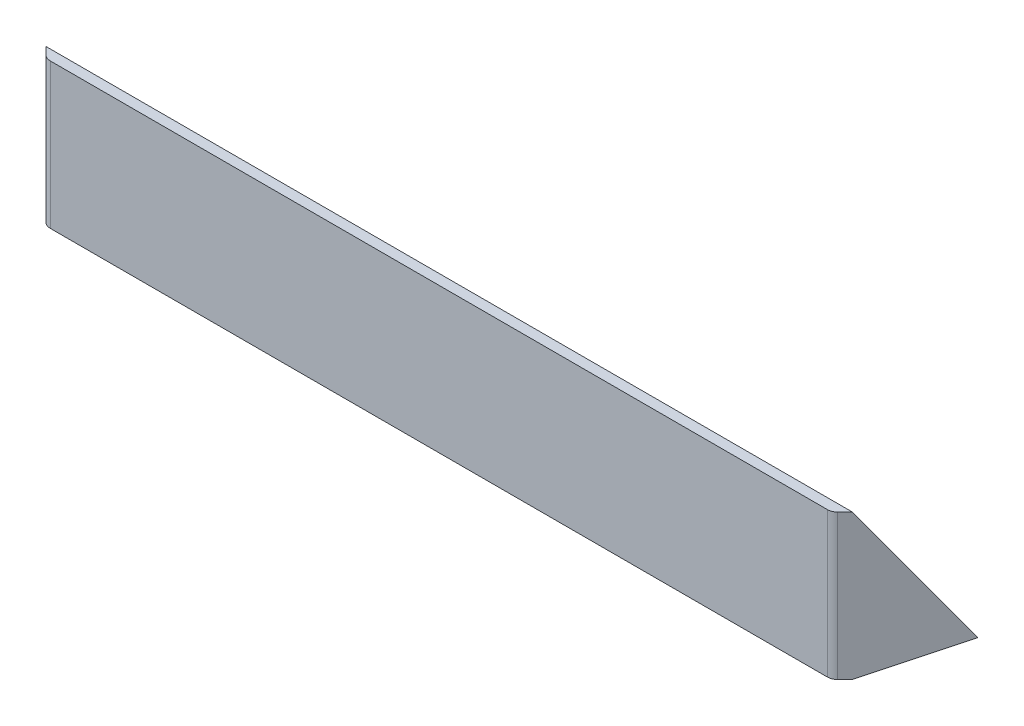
ISO-10303-21;
HEADER;
FILE_DESCRIPTION(('STEP AP214'),'2;1');
FILE_NAME('part.step','',(''),(''),'','','');
FILE_SCHEMA(('AUTOMOTIVE_DESIGN { 1 0 10303 214 1 1 1 1 }'));
ENDSEC;
DATA;
#1=APPLICATION_CONTEXT('core data for automotive mechanical design processes');
#2=APPLICATION_PROTOCOL_DEFINITION('international standard','automotive_design',2000,#1);
#3=PRODUCT_CONTEXT('',#1,'mechanical');
#4=PRODUCT('Part','Part','',(#3));
#5=PRODUCT_RELATED_PRODUCT_CATEGORY('part','',(#4));
#6=PRODUCT_DEFINITION_FORMATION('','',#4);
#7=PRODUCT_DEFINITION_CONTEXT('part definition',#1,'design');
#8=PRODUCT_DEFINITION('design','',#6,#7);
#9=PRODUCT_DEFINITION_SHAPE('','',#8);
#10=(LENGTH_UNIT() NAMED_UNIT(*) SI_UNIT(.MILLI.,.METRE.));
#11=(NAMED_UNIT(*) PLANE_ANGLE_UNIT() SI_UNIT($,.RADIAN.));
#12=(NAMED_UNIT(*) SI_UNIT($,.STERADIAN.) SOLID_ANGLE_UNIT());
#13=UNCERTAINTY_MEASURE_WITH_UNIT(LENGTH_MEASURE(1.E-05),#10,'distance_accuracy_value','');
#14=(GEOMETRIC_REPRESENTATION_CONTEXT(3) GLOBAL_UNCERTAINTY_ASSIGNED_CONTEXT((#13)) GLOBAL_UNIT_ASSIGNED_CONTEXT((#10,
#11,#12)) REPRESENTATION_CONTEXT('',''));
#15=CARTESIAN_POINT('',(0.,0.,0.));
#16=DIRECTION('',(0.,0.,1.));
#17=DIRECTION('',(1.,0.,0.));
#18=AXIS2_PLACEMENT_3D('',#15,#16,#17);
#19=CARTESIAN_POINT('',(379.142135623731,140.,0.));
#20=DIRECTION('',(-0.707106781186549,0.,-0.707106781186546));
#21=DIRECTION('',(-0.707106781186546,0.,0.707106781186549));
#22=AXIS2_PLACEMENT_3D('',#19,#20,#21);
#23=PLANE('',#22);
#24=DIRECTION('',(0.707106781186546,0.,-0.707106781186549));
#25=VECTOR('',#24,1.);
#26=CARTESIAN_POINT('',(379.142135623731,0.,0.));
#27=LINE('',#26,#25);
#28=CARTESIAN_POINT('',(382.071067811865,0.,-2.92893218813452));
#29=VERTEX_POINT('',#28);
#30=CARTESIAN_POINT('',(389.142135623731,0.,-10.0000000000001));
#31=VERTEX_POINT('',#30);
#32=EDGE_CURVE('E140',#29,#31,#27,.T.);
#33=ORIENTED_EDGE('',*,*,#32,.T.);
#34=DIRECTION('',(0.654653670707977,0.377964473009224,-0.65465367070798));
#35=VECTOR('',#34,1.);
#36=CARTESIAN_POINT('',(415.211723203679,15.0512834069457,-36.0695875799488));
#37=LINE('',#36,#35);
#38=CARTESIAN_POINT('',(449.763913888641,34.9999999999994,-70.6217782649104));
#39=VERTEX_POINT('',#38);
#40=EDGE_CURVE('E44',#31,#39,#37,.T.);
#41=ORIENTED_EDGE('',*,*,#40,.T.);
#42=DIRECTION('',(-0.447213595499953,0.774596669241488,0.447213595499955));
#43=VECTOR('',#42,1.);
#44=CARTESIAN_POINT('',(385.142135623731,146.928203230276,-6.0000000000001));
#45=LINE('',#44,#43);
#46=CARTESIAN_POINT('',(389.142135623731,140.,-10.));
#47=VERTEX_POINT('',#46);
#48=EDGE_CURVE('E186',#39,#47,#45,.T.);
#49=ORIENTED_EDGE('',*,*,#48,.T.);
#50=DIRECTION('',(0.707106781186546,0.,-0.707106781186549));
#51=VECTOR('',#50,1.);
#52=CARTESIAN_POINT('',(379.142135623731,140.,0.));
#53=LINE('',#52,#51);
#54=CARTESIAN_POINT('',(382.071067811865,140.,-2.92893218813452));
#55=VERTEX_POINT('',#54);
#56=EDGE_CURVE('E138',#55,#47,#53,.T.);
#57=ORIENTED_EDGE('',*,*,#56,.F.);
#58=DIRECTION('',(0.,-1.,0.));
#59=VECTOR('',#58,1.);
#60=CARTESIAN_POINT('',(382.071067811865,140.,-2.92893218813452));
#61=LINE('',#60,#59);
#62=EDGE_CURVE('E171',#55,#29,#61,.T.);
#63=ORIENTED_EDGE('',*,*,#62,.T.);
#64=EDGE_LOOP('',(#33,#41,#49,#57,#63));
#65=FACE_BOUND('',#64,.T.);
#66=ADVANCED_FACE('F30',(#65),#23,.F.);
#67=CARTESIAN_POINT('',(447.928932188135,140.,-82.928932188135));
#68=DIRECTION('',(0.70710678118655,0.,0.707106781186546));
#69=DIRECTION('',(0.707106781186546,0.,-0.70710678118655));
#70=AXIS2_PLACEMENT_3D('',#67,#68,#69);
#71=PLANE('',#70);
#72=DIRECTION('',(0.447213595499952,-0.774596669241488,-0.447213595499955));
#73=VECTOR('',#72,1.);
#74=CARTESIAN_POINT('',(404.171572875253,89.4733536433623,-39.1715728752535));
#75=LINE('',#74,#73);
#76=CARTESIAN_POINT('',(375.,140.,-10.0000000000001));
#77=VERTEX_POINT('',#76);
#78=CARTESIAN_POINT('',(435.62177826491,34.9999999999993,-70.6217782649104));
#79=VERTEX_POINT('',#78);
#80=EDGE_CURVE('E179',#77,#79,#75,.T.);
#81=ORIENTED_EDGE('',*,*,#80,.T.);
#82=DIRECTION('',(-0.654653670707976,-0.377964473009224,0.65465367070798));
#83=VECTOR('',#82,1.);
#84=CARTESIAN_POINT('',(472.151529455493,56.0904616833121,-107.151529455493));
#85=LINE('',#84,#83);
#86=CARTESIAN_POINT('',(375.,0.,-10.0000000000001));
#87=VERTEX_POINT('',#86);
#88=EDGE_CURVE('E190',#79,#87,#85,.T.);
#89=ORIENTED_EDGE('',*,*,#88,.T.);
#90=DIRECTION('',(0.,-1.,0.));
#91=VECTOR('',#90,1.);
#92=CARTESIAN_POINT('',(375.,140.,-10.0000000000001));
#93=LINE('',#92,#91);
#94=EDGE_CURVE('E155',#77,#87,#93,.T.);
#95=ORIENTED_EDGE('',*,*,#94,.F.);
#96=EDGE_LOOP('',(#81,#89,#95));
#97=FACE_BOUND('',#96,.T.);
#98=ADVANCED_FACE('F204',(#97),#71,.F.);
#99=CARTESIAN_POINT('',(375.,140.,-10.0000000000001));
#100=DIRECTION('',(0.,0.,1.));
#101=DIRECTION('',(1.,0.,0.));
#102=AXIS2_PLACEMENT_3D('',#99,#100,#101);
#103=PLANE('',#102);
#104=DIRECTION('',(-1.,0.,0.));
#105=VECTOR('',#104,1.);
#106=CARTESIAN_POINT('',(375.,0.,-10.0000000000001));
#107=LINE('',#106,#105);
#108=CARTESIAN_POINT('',(-375.,0.,-10.0000000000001));
#109=VERTEX_POINT('',#108);
#110=EDGE_CURVE('E135',#87,#109,#107,.T.);
#111=ORIENTED_EDGE('',*,*,#110,.T.);
#112=DIRECTION('',(0.,-1.,0.));
#113=VECTOR('',#112,1.);
#114=CARTESIAN_POINT('',(-375.,140.,-10.0000000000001));
#115=LINE('',#114,#113);
#116=CARTESIAN_POINT('',(-375.,140.,-10.));
#117=VERTEX_POINT('',#116);
#118=EDGE_CURVE('E152',#117,#109,#115,.T.);
#119=ORIENTED_EDGE('',*,*,#118,.F.);
#120=DIRECTION('',(-1.,0.,0.));
#121=VECTOR('',#120,1.);
#122=CARTESIAN_POINT('',(375.,140.,-10.0000000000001));
#123=LINE('',#122,#121);
#124=EDGE_CURVE('E145',#77,#117,#123,.T.);
#125=ORIENTED_EDGE('',*,*,#124,.F.);
#126=ORIENTED_EDGE('',*,*,#94,.T.);
#127=EDGE_LOOP('',(#111,#119,#125,#126));
#128=FACE_BOUND('',#127,.T.);
#129=ADVANCED_FACE('F201',(#128),#103,.F.);
#130=CARTESIAN_POINT('',(-447.928932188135,140.,-82.9289321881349));
#131=DIRECTION('',(-0.707106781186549,0.,0.707106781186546));
#132=DIRECTION('',(0.707106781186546,0.,0.707106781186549));
#133=AXIS2_PLACEMENT_3D('',#130,#131,#132);
#134=PLANE('',#133);
#135=ORIENTED_EDGE('',*,*,#118,.T.);
#136=DIRECTION('',(-0.654653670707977,0.377964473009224,-0.65465367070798));
#137=VECTOR('',#136,1.);
#138=CARTESIAN_POINT('',(-472.151529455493,56.0904616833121,-107.151529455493));
#139=LINE('',#138,#137);
#140=CARTESIAN_POINT('',(-435.62177826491,34.9999999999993,-70.6217782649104));
#141=VERTEX_POINT('',#140);
#142=EDGE_CURVE('E114',#109,#141,#139,.T.);
#143=ORIENTED_EDGE('',*,*,#142,.T.);
#144=DIRECTION('',(0.447213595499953,0.774596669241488,0.447213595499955));
#145=VECTOR('',#144,1.);
#146=CARTESIAN_POINT('',(-404.171572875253,89.4733536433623,-39.1715728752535));
#147=LINE('',#146,#145);
#148=EDGE_CURVE('E181',#141,#117,#147,.T.);
#149=ORIENTED_EDGE('',*,*,#148,.T.);
#150=EDGE_LOOP('',(#135,#143,#149));
#151=FACE_BOUND('',#150,.T.);
#152=ADVANCED_FACE('F197',(#151),#134,.F.);
#153=CARTESIAN_POINT('',(-379.142135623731,140.,0.));
#154=DIRECTION('',(0.707106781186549,0.,-0.707106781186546));
#155=DIRECTION('',(-0.707106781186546,0.,-0.707106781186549));
#156=AXIS2_PLACEMENT_3D('',#153,#154,#155);
#157=PLANE('',#156);
#158=DIRECTION('',(-0.447213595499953,-0.774596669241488,-0.447213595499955));
#159=VECTOR('',#158,1.);
#160=CARTESIAN_POINT('',(-385.142135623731,146.928203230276,-6.0000000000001));
#161=LINE('',#160,#159);
#162=CARTESIAN_POINT('',(-389.142135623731,140.,-10.));
#163=VERTEX_POINT('',#162);
#164=CARTESIAN_POINT('',(-449.763913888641,34.9999999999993,-70.6217782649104));
#165=VERTEX_POINT('',#164);
#166=EDGE_CURVE('E127',#163,#165,#161,.T.);
#167=ORIENTED_EDGE('',*,*,#166,.T.);
#168=DIRECTION('',(0.654653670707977,-0.377964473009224,0.65465367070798));
#169=VECTOR('',#168,1.);
#170=CARTESIAN_POINT('',(-415.211723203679,15.0512834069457,-36.0695875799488));
#171=LINE('',#170,#169);
#172=CARTESIAN_POINT('',(-389.142135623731,0.,-10.0000000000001));
#173=VERTEX_POINT('',#172);
#174=EDGE_CURVE('E111',#165,#173,#171,.T.);
#175=ORIENTED_EDGE('',*,*,#174,.T.);
#176=DIRECTION('',(0.707106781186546,0.,0.707106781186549));
#177=VECTOR('',#176,1.);
#178=CARTESIAN_POINT('',(-379.142135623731,0.,0.));
#179=LINE('',#178,#177);
#180=CARTESIAN_POINT('',(-382.071067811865,0.,-2.92893218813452));
#181=VERTEX_POINT('',#180);
#182=EDGE_CURVE('E124',#173,#181,#179,.T.);
#183=ORIENTED_EDGE('',*,*,#182,.T.);
#184=DIRECTION('',(0.,-1.,0.));
#185=VECTOR('',#184,1.);
#186=CARTESIAN_POINT('',(-382.071067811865,140.,-2.92893218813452));
#187=LINE('',#186,#185);
#188=CARTESIAN_POINT('',(-382.071067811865,140.,-2.92893218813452));
#189=VERTEX_POINT('',#188);
#190=EDGE_CURVE('E166',#181,#189,#187,.F.);
#191=ORIENTED_EDGE('',*,*,#190,.T.);
#192=DIRECTION('',(0.707106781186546,0.,0.707106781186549));
#193=VECTOR('',#192,1.);
#194=CARTESIAN_POINT('',(-379.142135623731,140.,0.));
#195=LINE('',#194,#193);
#196=EDGE_CURVE('E148',#163,#189,#195,.T.);
#197=ORIENTED_EDGE('',*,*,#196,.F.);
#198=EDGE_LOOP('',(#167,#175,#183,#191,#197));
#199=FACE_BOUND('',#198,.T.);
#200=ADVANCED_FACE('F122',(#199),#157,.F.);
#201=CARTESIAN_POINT('',(-379.142135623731,140.,0.));
#202=DIRECTION('',(0.,0.,-1.));
#203=DIRECTION('',(-1.,0.,0.));
#204=AXIS2_PLACEMENT_3D('',#201,#202,#203);
#205=PLANE('',#204);
#206=DIRECTION('',(1.,0.,0.));
#207=VECTOR('',#206,1.);
#208=CARTESIAN_POINT('',(-379.142135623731,140.,0.));
#209=LINE('',#208,#207);
#210=CARTESIAN_POINT('',(-375.,140.,0.));
#211=VERTEX_POINT('',#210);
#212=CARTESIAN_POINT('',(375.,140.,0.));
#213=VERTEX_POINT('',#212);
#214=EDGE_CURVE('E150',#211,#213,#209,.T.);
#215=ORIENTED_EDGE('',*,*,#214,.F.);
#216=DIRECTION('',(0.,-1.,0.));
#217=VECTOR('',#216,1.);
#218=CARTESIAN_POINT('',(-375.,140.,0.));
#219=LINE('',#218,#217);
#220=CARTESIAN_POINT('',(-375.,0.,0.));
#221=VERTEX_POINT('',#220);
#222=EDGE_CURVE('E160',#211,#221,#219,.T.);
#223=ORIENTED_EDGE('',*,*,#222,.T.);
#224=DIRECTION('',(1.,0.,0.));
#225=VECTOR('',#224,1.);
#226=CARTESIAN_POINT('',(-379.142135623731,0.,0.));
#227=LINE('',#226,#225);
#228=CARTESIAN_POINT('',(375.,0.,0.));
#229=VERTEX_POINT('',#228);
#230=EDGE_CURVE('E134',#221,#229,#227,.T.);
#231=ORIENTED_EDGE('',*,*,#230,.T.);
#232=DIRECTION('',(0.,-1.,0.));
#233=VECTOR('',#232,1.);
#234=CARTESIAN_POINT('',(375.,140.,0.));
#235=LINE('',#234,#233);
#236=EDGE_CURVE('E158',#229,#213,#235,.F.);
#237=ORIENTED_EDGE('',*,*,#236,.T.);
#238=EDGE_LOOP('',(#215,#223,#231,#237));
#239=FACE_BOUND('',#238,.T.);
#240=ADVANCED_FACE('F217',(#239),#205,.F.);
#241=CARTESIAN_POINT('',(455.,140.,-75.8578643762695));
#242=DIRECTION('',(0.,1.,0.));
#243=DIRECTION('',(0.,0.,1.));
#244=AXIS2_PLACEMENT_3D('',#241,#242,#243);
#245=PLANE('',#244);
#246=DIRECTION('',(1.,0.,0.));
#247=VECTOR('',#246,1.);
#248=CARTESIAN_POINT('',(455.,140.,-10.));
#249=LINE('',#248,#247);
#250=EDGE_CURVE('E11',#163,#117,#249,.T.);
#251=ORIENTED_EDGE('',*,*,#250,.F.);
#252=ORIENTED_EDGE('',*,*,#196,.T.);
#253=CARTESIAN_POINT('',(-375.,140.,-10.));
#254=DIRECTION('',(0.,1.,0.));
#255=DIRECTION('',(0.,0.,1.));
#256=AXIS2_PLACEMENT_3D('',#253,#254,#255);
#257=CIRCLE('',#256,10.);
#258=EDGE_CURVE('E169',#189,#211,#257,.T.);
#259=ORIENTED_EDGE('',*,*,#258,.T.);
#260=ORIENTED_EDGE('',*,*,#214,.T.);
#261=CARTESIAN_POINT('',(375.,140.,-10.));
#262=DIRECTION('',(0.,1.,0.));
#263=DIRECTION('',(0.,0.,1.));
#264=AXIS2_PLACEMENT_3D('',#261,#262,#263);
#265=CIRCLE('',#264,10.);
#266=EDGE_CURVE('E52',#213,#55,#265,.T.);
#267=ORIENTED_EDGE('',*,*,#266,.T.);
#268=ORIENTED_EDGE('',*,*,#56,.T.);
#269=EDGE_CURVE('E33',#77,#47,#249,.T.);
#270=ORIENTED_EDGE('',*,*,#269,.F.);
#271=ORIENTED_EDGE('',*,*,#124,.T.);
#272=EDGE_LOOP('',(#251,#252,#259,#260,#267,#268,#270,#271));
#273=FACE_BOUND('',#272,.T.);
#274=ADVANCED_FACE('F210',(#273),#245,.T.);
#275=CARTESIAN_POINT('',(455.,0.,-75.8578643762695));
#276=DIRECTION('',(0.,1.,0.));
#277=DIRECTION('',(0.,0.,1.));
#278=AXIS2_PLACEMENT_3D('',#275,#276,#277);
#279=PLANE('',#278);
#280=ORIENTED_EDGE('',*,*,#182,.F.);
#281=DIRECTION('',(1.,0.,0.));
#282=VECTOR('',#281,1.);
#283=CARTESIAN_POINT('',(455.,0.,-10.0000000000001));
#284=LINE('',#283,#282);
#285=EDGE_CURVE('E107',#173,#109,#284,.T.);
#286=ORIENTED_EDGE('',*,*,#285,.T.);
#287=ORIENTED_EDGE('',*,*,#110,.F.);
#288=EDGE_CURVE('E119',#87,#31,#284,.T.);
#289=ORIENTED_EDGE('',*,*,#288,.T.);
#290=ORIENTED_EDGE('',*,*,#32,.F.);
#291=CARTESIAN_POINT('',(375.,0.,-10.));
#292=DIRECTION('',(0.,1.,0.));
#293=DIRECTION('',(0.,0.,1.));
#294=AXIS2_PLACEMENT_3D('',#291,#292,#293);
#295=CIRCLE('',#294,10.);
#296=EDGE_CURVE('E163',#29,#229,#295,.F.);
#297=ORIENTED_EDGE('',*,*,#296,.T.);
#298=ORIENTED_EDGE('',*,*,#230,.F.);
#299=CARTESIAN_POINT('',(-375.,0.,-10.));
#300=DIRECTION('',(0.,1.,0.));
#301=DIRECTION('',(0.,0.,1.));
#302=AXIS2_PLACEMENT_3D('',#299,#300,#301);
#303=CIRCLE('',#302,10.);
#304=EDGE_CURVE('E132',#221,#181,#303,.F.);
#305=ORIENTED_EDGE('',*,*,#304,.T.);
#306=EDGE_LOOP('',(#280,#286,#287,#289,#290,#297,#298,#305));
#307=FACE_BOUND('',#306,.T.);
#308=ADVANCED_FACE('F130',(#307),#279,.F.);
#309=CARTESIAN_POINT('',(-375.,140.,-10.));
#310=DIRECTION('',(0.,-1.,0.));
#311=DIRECTION('',(0.,0.,-1.));
#312=AXIS2_PLACEMENT_3D('',#309,#310,#311);
#313=CYLINDRICAL_SURFACE('',#312,10.);
#314=ORIENTED_EDGE('',*,*,#258,.F.);
#315=ORIENTED_EDGE('',*,*,#190,.F.);
#316=ORIENTED_EDGE('',*,*,#304,.F.);
#317=ORIENTED_EDGE('',*,*,#222,.F.);
#318=EDGE_LOOP('',(#314,#315,#316,#317));
#319=FACE_BOUND('',#318,.T.);
#320=ADVANCED_FACE('F214',(#319),#313,.T.);
#321=CARTESIAN_POINT('',(375.,140.,-10.));
#322=DIRECTION('',(0.,-1.,0.));
#323=DIRECTION('',(0.,0.,-1.));
#324=AXIS2_PLACEMENT_3D('',#321,#322,#323);
#325=CYLINDRICAL_SURFACE('',#324,10.);
#326=ORIENTED_EDGE('',*,*,#266,.F.);
#327=ORIENTED_EDGE('',*,*,#236,.F.);
#328=ORIENTED_EDGE('',*,*,#296,.F.);
#329=ORIENTED_EDGE('',*,*,#62,.F.);
#330=EDGE_LOOP('',(#326,#327,#328,#329));
#331=FACE_BOUND('',#330,.T.);
#332=ADVANCED_FACE('F220',(#331),#325,.T.);
#333=CARTESIAN_POINT('',(-455.,0.,-10.0000000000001));
#334=DIRECTION('',(0.,0.866025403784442,0.499999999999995));
#335=DIRECTION('',(0.,-0.499999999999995,0.866025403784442));
#336=AXIS2_PLACEMENT_3D('',#333,#334,#335);
#337=PLANE('',#336);
#338=ORIENTED_EDGE('',*,*,#288,.F.);
#339=ORIENTED_EDGE('',*,*,#88,.F.);
#340=DIRECTION('',(1.,0.,0.));
#341=VECTOR('',#340,1.);
#342=CARTESIAN_POINT('',(-455.,34.9999999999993,-70.6217782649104));
#343=LINE('',#342,#341);
#344=EDGE_CURVE('E193',#79,#39,#343,.T.);
#345=ORIENTED_EDGE('',*,*,#344,.T.);
#346=ORIENTED_EDGE('',*,*,#40,.F.);
#347=EDGE_LOOP('',(#338,#339,#345,#346));
#348=FACE_BOUND('',#347,.T.);
#349=ADVANCED_FACE('F205',(#348),#337,.F.);
#350=CARTESIAN_POINT('',(-455.,34.9999999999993,-70.6217782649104));
#351=DIRECTION('',(0.,-0.499999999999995,0.866025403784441));
#352=DIRECTION('',(0.,-0.866025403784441,-0.499999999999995));
#353=AXIS2_PLACEMENT_3D('',#350,#351,#352);
#354=PLANE('',#353);
#355=ORIENTED_EDGE('',*,*,#269,.T.);
#356=ORIENTED_EDGE('',*,*,#48,.F.);
#357=ORIENTED_EDGE('',*,*,#344,.F.);
#358=ORIENTED_EDGE('',*,*,#80,.F.);
#359=EDGE_LOOP('',(#355,#356,#357,#358));
#360=FACE_BOUND('',#359,.T.);
#361=ADVANCED_FACE('F207',(#360),#354,.F.);
#362=EDGE_CURVE('E128',#165,#141,#343,.T.);
#363=ORIENTED_EDGE('',*,*,#362,.F.);
#364=ORIENTED_EDGE('',*,*,#166,.F.);
#365=ORIENTED_EDGE('',*,*,#250,.T.);
#366=ORIENTED_EDGE('',*,*,#148,.F.);
#367=EDGE_LOOP('',(#363,#364,#365,#366));
#368=FACE_BOUND('',#367,.T.);
#369=ADVANCED_FACE('F313',(#368),#354,.F.);
#370=ORIENTED_EDGE('',*,*,#285,.F.);
#371=ORIENTED_EDGE('',*,*,#174,.F.);
#372=ORIENTED_EDGE('',*,*,#362,.T.);
#373=ORIENTED_EDGE('',*,*,#142,.F.);
#374=EDGE_LOOP('',(#370,#371,#372,#373));
#375=FACE_BOUND('',#374,.T.);
#376=ADVANCED_FACE('F109',(#375),#337,.F.);
#377=CLOSED_SHELL('',(#66,#98,#129,#152,#200,#240,#274,#308,#320,#332,#349,#361,#369,#376));
#378=MANIFOLD_SOLID_BREP('B2',#377);
#379=ADVANCED_BREP_SHAPE_REPRESENTATION('',(#18,#378),#14);
#380=SHAPE_DEFINITION_REPRESENTATION(#9,#379);
ENDSEC;
END-ISO-10303-21;
